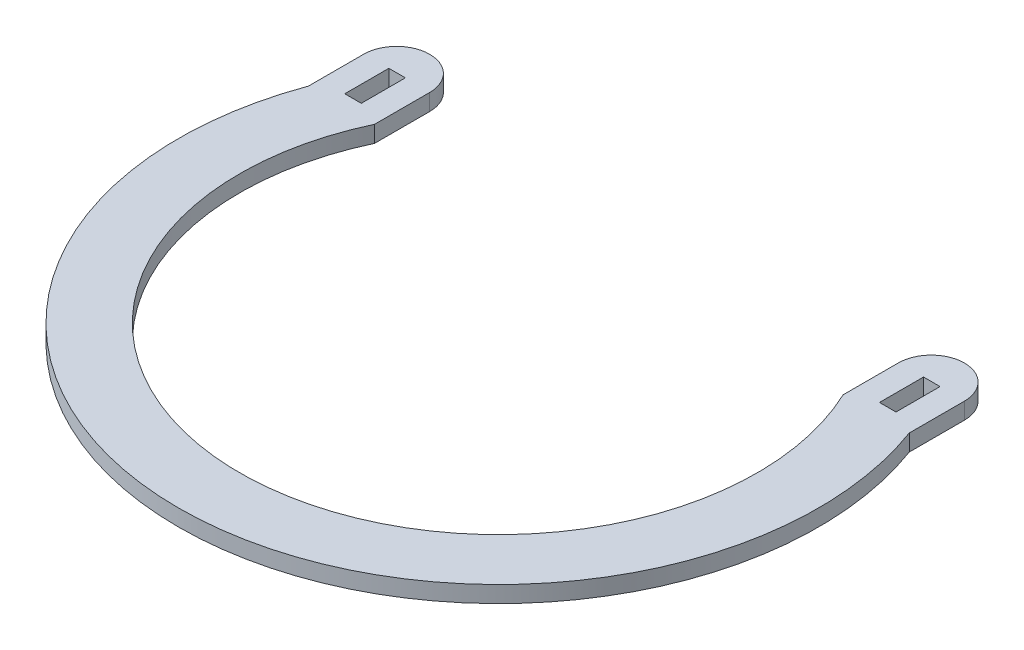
from build123d import *

# Parameters (mm, degrees)
ESQUISSE1_W        = 3
ESQUISSE1_H        = 8
BOSS_EXTRU_1_DEPTH = 3


with BuildPart() as part:
    # Esquisse1 → Boss.-Extru.1 (new body)
    with BuildSketch(Plane(origin=(0, 0, 0), x_dir=(1, 0, 0), z_dir=(0, 1, 0))):
        with BuildLine():
            Line((-54.5, 20.013068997), (-54.5, 30.013068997))
            ThreePointArc((-54.5, 30.013068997), (-48.5, 36.013068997), (-42.5, 30.013068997))
            Line((-42.5, 30.013068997), (-42.5, 20.013068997))
            ThreePointArc((-42.5, 20.013068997), (0, -46.976301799), (42.5, 20.013068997))
            Line((42.5, 20.013068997), (42.5, 30.013068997))
            ThreePointArc((42.5, 30.013068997), (48.5, 36.013068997), (54.5, 30.013068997))
            Line((54.5, 30.013068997), (54.5, 20.013068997))
            ThreePointArc((54.5, 20.013068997), (0, -58.058357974), (-54.5, 20.013068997))
        make_face()
        with Locations((48.5, 26.104694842)):
            Rectangle(ESQUISSE1_W, ESQUISSE1_H, mode=Mode.SUBTRACT)
        with Locations((-48.5, 26.104694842)):
            Rectangle(ESQUISSE1_W, ESQUISSE1_H, mode=Mode.SUBTRACT)
    extrude(amount=BOSS_EXTRU_1_DEPTH)


solid = part.part
